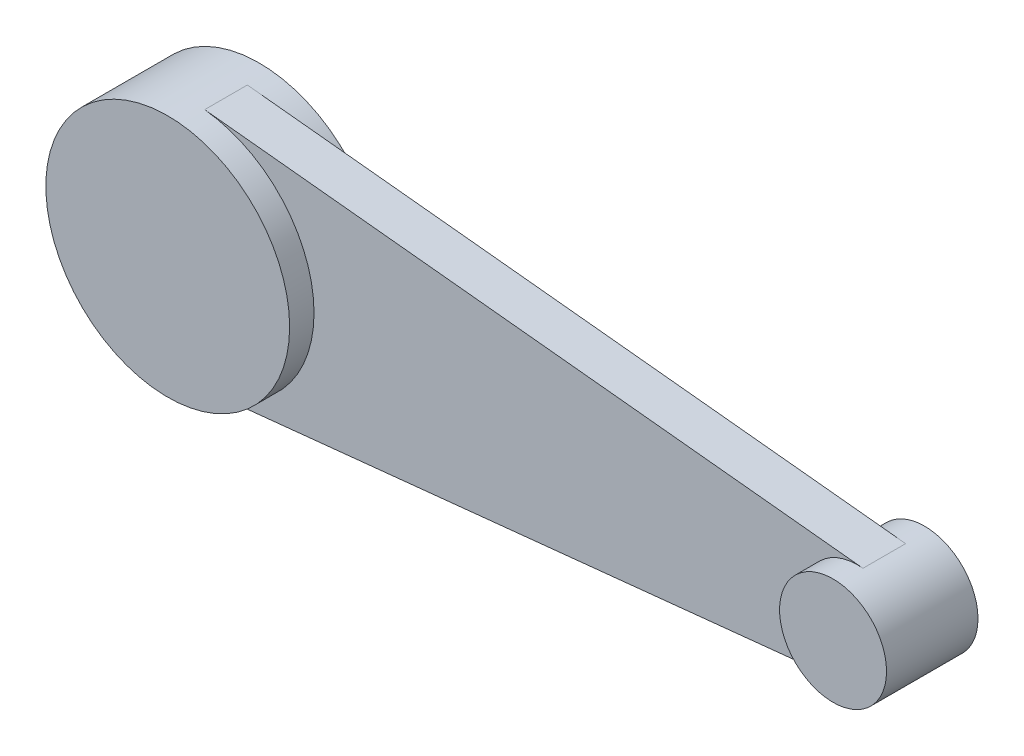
ISO-10303-21;
HEADER;
FILE_DESCRIPTION(('STEP AP214'),'2;1');
FILE_NAME('part.step','',(''),(''),'','','');
FILE_SCHEMA(('AUTOMOTIVE_DESIGN { 1 0 10303 214 1 1 1 1 }'));
ENDSEC;
DATA;
#1=APPLICATION_CONTEXT('core data for automotive mechanical design processes');
#2=APPLICATION_PROTOCOL_DEFINITION('international standard','automotive_design',2000,#1);
#3=PRODUCT_CONTEXT('',#1,'mechanical');
#4=PRODUCT('Part','Part','',(#3));
#5=PRODUCT_RELATED_PRODUCT_CATEGORY('part','',(#4));
#6=PRODUCT_DEFINITION_FORMATION('','',#4);
#7=PRODUCT_DEFINITION_CONTEXT('part definition',#1,'design');
#8=PRODUCT_DEFINITION('design','',#6,#7);
#9=PRODUCT_DEFINITION_SHAPE('','',#8);
#10=(LENGTH_UNIT() NAMED_UNIT(*) SI_UNIT(.MILLI.,.METRE.));
#11=(NAMED_UNIT(*) PLANE_ANGLE_UNIT() SI_UNIT($,.RADIAN.));
#12=(NAMED_UNIT(*) SI_UNIT($,.STERADIAN.) SOLID_ANGLE_UNIT());
#13=UNCERTAINTY_MEASURE_WITH_UNIT(LENGTH_MEASURE(1.E-05),#10,'distance_accuracy_value','');
#14=(GEOMETRIC_REPRESENTATION_CONTEXT(3) GLOBAL_UNCERTAINTY_ASSIGNED_CONTEXT((#13)) GLOBAL_UNIT_ASSIGNED_CONTEXT((#10,
#11,#12)) REPRESENTATION_CONTEXT('',''));
#15=CARTESIAN_POINT('',(0.,0.,0.));
#16=DIRECTION('',(0.,0.,1.));
#17=DIRECTION('',(1.,0.,0.));
#18=AXIS2_PLACEMENT_3D('',#15,#16,#17);
#19=CARTESIAN_POINT('',(-81.872176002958,0.,9.525));
#20=DIRECTION('',(0.,0.,-1.));
#21=DIRECTION('',(-1.,0.,0.));
#22=AXIS2_PLACEMENT_3D('',#19,#20,#21);
#23=CYLINDRICAL_SURFACE('',#22,25.3908383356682);
#24=DIRECTION('',(0.,0.,-1.));
#25=VECTOR('',#24,1.);
#26=CARTESIAN_POINT('',(-79.2607908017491,-25.2561940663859,4.445));
#27=LINE('',#26,#25);
#28=CARTESIAN_POINT('',(-79.2607908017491,-25.2561940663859,4.445));
#29=VERTEX_POINT('',#28);
#30=CARTESIAN_POINT('',(-79.2607908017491,-25.2561940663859,-4.445));
#31=VERTEX_POINT('',#30);
#32=EDGE_CURVE('E41',#29,#31,#27,.T.);
#33=ORIENTED_EDGE('',*,*,#32,.F.);
#34=CARTESIAN_POINT('',(-81.872176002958,0.,4.445));
#35=DIRECTION('',(0.,0.,-1.));
#36=DIRECTION('',(1.,0.,0.));
#37=AXIS2_PLACEMENT_3D('',#34,#35,#36);
#38=CIRCLE('',#37,25.3908383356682);
#39=CARTESIAN_POINT('',(-79.2607908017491,25.2561940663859,4.445));
#40=VERTEX_POINT('',#39);
#41=EDGE_CURVE('E46',#40,#29,#38,.T.);
#42=ORIENTED_EDGE('',*,*,#41,.F.);
#43=DIRECTION('',(0.,0.,-1.));
#44=VECTOR('',#43,1.);
#45=CARTESIAN_POINT('',(-79.2607908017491,25.2561940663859,4.445));
#46=LINE('',#45,#44);
#47=CARTESIAN_POINT('',(-79.2607908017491,25.2561940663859,-4.445));
#48=VERTEX_POINT('',#47);
#49=EDGE_CURVE('E86',#40,#48,#46,.T.);
#50=ORIENTED_EDGE('',*,*,#49,.T.);
#51=CARTESIAN_POINT('',(-81.872176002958,0.,-4.445));
#52=DIRECTION('',(0.,0.,-1.));
#53=DIRECTION('',(1.,0.,0.));
#54=AXIS2_PLACEMENT_3D('',#51,#52,#53);
#55=CIRCLE('',#54,25.3908383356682);
#56=EDGE_CURVE('E74',#48,#31,#55,.T.);
#57=ORIENTED_EDGE('',*,*,#56,.T.);
#58=EDGE_LOOP('',(#33,#42,#50,#57));
#59=FACE_BOUND('',#58,.T.);
#60=CARTESIAN_POINT('',(-81.872176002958,0.,9.525));
#61=DIRECTION('',(0.,0.,1.));
#62=DIRECTION('',(1.,0.,0.));
#63=AXIS2_PLACEMENT_3D('',#60,#61,#62);
#64=CIRCLE('',#63,25.3908383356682);
#65=CARTESIAN_POINT('',(-56.4813376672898,0.,9.525));
#66=VERTEX_POINT('',#65);
#67=EDGE_CURVE('E11',#66,#66,#64,.T.);
#68=ORIENTED_EDGE('',*,*,#67,.F.);
#69=EDGE_LOOP('',(#68));
#70=FACE_BOUND('',#69,.T.);
#71=CARTESIAN_POINT('',(-81.872176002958,0.,-9.525));
#72=DIRECTION('',(0.,0.,1.));
#73=DIRECTION('',(1.,0.,0.));
#74=AXIS2_PLACEMENT_3D('',#71,#72,#73);
#75=CIRCLE('',#74,25.3908383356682);
#76=CARTESIAN_POINT('',(-56.4813376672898,0.,-9.525));
#77=VERTEX_POINT('',#76);
#78=EDGE_CURVE('E34',#77,#77,#75,.T.);
#79=ORIENTED_EDGE('',*,*,#78,.T.);
#80=EDGE_LOOP('',(#79));
#81=FACE_BOUND('',#80,.T.);
#82=ADVANCED_FACE('F27',(#59,#70,#81),#23,.T.);
#83=CARTESIAN_POINT('',(-81.872176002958,0.,9.525));
#84=DIRECTION('',(0.,0.,1.));
#85=DIRECTION('',(1.,0.,0.));
#86=AXIS2_PLACEMENT_3D('',#83,#84,#85);
#87=PLANE('',#86);
#88=ORIENTED_EDGE('',*,*,#67,.T.);
#89=EDGE_LOOP('',(#88));
#90=FACE_BOUND('',#89,.T.);
#91=ADVANCED_FACE('F111',(#90),#87,.T.);
#92=CARTESIAN_POINT('',(-81.872176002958,0.,-9.525));
#93=DIRECTION('',(0.,0.,1.));
#94=DIRECTION('',(1.,0.,0.));
#95=AXIS2_PLACEMENT_3D('',#92,#93,#94);
#96=PLANE('',#95);
#97=ORIENTED_EDGE('',*,*,#78,.F.);
#98=EDGE_LOOP('',(#97));
#99=FACE_BOUND('',#98,.T.);
#100=ADVANCED_FACE('F108',(#99),#96,.F.);
#101=CARTESIAN_POINT('',(-79.2607908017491,-25.2561940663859,4.445));
#102=DIRECTION('',(-0.102847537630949,0.994697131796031,0.));
#103=DIRECTION('',(-0.994697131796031,-0.102847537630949,0.));
#104=AXIS2_PLACEMENT_3D('',#101,#102,#103);
#105=PLANE('',#104);
#106=DIRECTION('',(0.994697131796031,0.102847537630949,0.));
#107=VECTOR('',#106,1.);
#108=CARTESIAN_POINT('',(-79.2607908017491,-25.2561940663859,-4.445));
#109=LINE('',#108,#107);
#110=CARTESIAN_POINT('',(57.8459146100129,-11.0799321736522,-4.445));
#111=VERTEX_POINT('',#110);
#112=EDGE_CURVE('E91',#31,#111,#109,.T.);
#113=ORIENTED_EDGE('',*,*,#112,.T.);
#114=DIRECTION('',(0.,0.,-1.));
#115=VECTOR('',#114,1.);
#116=CARTESIAN_POINT('',(57.8459146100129,-11.0799321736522,4.445));
#117=LINE('',#116,#115);
#118=CARTESIAN_POINT('',(57.8459146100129,-11.0799321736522,4.445));
#119=VERTEX_POINT('',#118);
#120=EDGE_CURVE('E85',#119,#111,#117,.T.);
#121=ORIENTED_EDGE('',*,*,#120,.F.);
#122=DIRECTION('',(0.994697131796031,0.102847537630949,0.));
#123=VECTOR('',#122,1.);
#124=CARTESIAN_POINT('',(-79.2607908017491,-25.2561940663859,4.445));
#125=LINE('',#124,#123);
#126=EDGE_CURVE('E97',#29,#119,#125,.T.);
#127=ORIENTED_EDGE('',*,*,#126,.F.);
#128=ORIENTED_EDGE('',*,*,#32,.T.);
#129=EDGE_LOOP('',(#113,#121,#127,#128));
#130=FACE_BOUND('',#129,.T.);
#131=ADVANCED_FACE('F110',(#130),#105,.F.);
#132=CARTESIAN_POINT('',(-79.2607908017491,25.2561940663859,4.445));
#133=DIRECTION('',(-0.102847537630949,-0.994697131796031,0.));
#134=DIRECTION('',(0.994697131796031,-0.102847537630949,0.));
#135=AXIS2_PLACEMENT_3D('',#132,#133,#134);
#136=PLANE('',#135);
#137=DIRECTION('',(-0.994697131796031,0.102847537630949,0.));
#138=VECTOR('',#137,1.);
#139=CARTESIAN_POINT('',(-79.2607908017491,25.2561940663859,-4.445));
#140=LINE('',#139,#138);
#141=CARTESIAN_POINT('',(57.8459146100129,11.0799321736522,-4.445));
#142=VERTEX_POINT('',#141);
#143=EDGE_CURVE('E67',#142,#48,#140,.T.);
#144=ORIENTED_EDGE('',*,*,#143,.T.);
#145=ORIENTED_EDGE('',*,*,#49,.F.);
#146=DIRECTION('',(-0.994697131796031,0.102847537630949,0.));
#147=VECTOR('',#146,1.);
#148=CARTESIAN_POINT('',(-79.2607908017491,25.2561940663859,4.445));
#149=LINE('',#148,#147);
#150=CARTESIAN_POINT('',(57.8459146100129,11.0799321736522,4.445));
#151=VERTEX_POINT('',#150);
#152=EDGE_CURVE('E82',#151,#40,#149,.T.);
#153=ORIENTED_EDGE('',*,*,#152,.F.);
#154=DIRECTION('',(0.,0.,-1.));
#155=VECTOR('',#154,1.);
#156=CARTESIAN_POINT('',(57.8459146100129,11.0799321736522,4.445));
#157=LINE('',#156,#155);
#158=EDGE_CURVE('E80',#151,#142,#157,.T.);
#159=ORIENTED_EDGE('',*,*,#158,.T.);
#160=EDGE_LOOP('',(#144,#145,#153,#159));
#161=FACE_BOUND('',#160,.T.);
#162=ADVANCED_FACE('F81',(#161),#136,.F.);
#163=CARTESIAN_POINT('',(-81.872176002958,0.,4.445));
#164=DIRECTION('',(0.,0.,1.));
#165=DIRECTION('',(1.,0.,0.));
#166=AXIS2_PLACEMENT_3D('',#163,#164,#165);
#167=PLANE('',#166);
#168=ORIENTED_EDGE('',*,*,#41,.T.);
#169=ORIENTED_EDGE('',*,*,#126,.T.);
#170=CARTESIAN_POINT('',(56.7002958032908,0.,4.445));
#171=DIRECTION('',(0.,0.,-1.));
#172=DIRECTION('',(1.,0.,0.));
#173=AXIS2_PLACEMENT_3D('',#170,#171,#172);
#174=CIRCLE('',#173,11.1390008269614);
#175=EDGE_CURVE('E99',#119,#151,#174,.T.);
#176=ORIENTED_EDGE('',*,*,#175,.T.);
#177=ORIENTED_EDGE('',*,*,#152,.T.);
#178=EDGE_LOOP('',(#168,#169,#176,#177));
#179=FACE_BOUND('',#178,.T.);
#180=ADVANCED_FACE('F137',(#179),#167,.T.);
#181=CARTESIAN_POINT('',(-81.872176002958,0.,-4.445));
#182=DIRECTION('',(0.,0.,1.));
#183=DIRECTION('',(1.,0.,0.));
#184=AXIS2_PLACEMENT_3D('',#181,#182,#183);
#185=PLANE('',#184);
#186=ORIENTED_EDGE('',*,*,#56,.F.);
#187=ORIENTED_EDGE('',*,*,#143,.F.);
#188=CARTESIAN_POINT('',(56.7002958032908,0.,-4.445));
#189=DIRECTION('',(0.,0.,-1.));
#190=DIRECTION('',(1.,0.,0.));
#191=AXIS2_PLACEMENT_3D('',#188,#189,#190);
#192=CIRCLE('',#191,11.1390008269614);
#193=EDGE_CURVE('E72',#111,#142,#192,.T.);
#194=ORIENTED_EDGE('',*,*,#193,.F.);
#195=ORIENTED_EDGE('',*,*,#112,.F.);
#196=EDGE_LOOP('',(#186,#187,#194,#195));
#197=FACE_BOUND('',#196,.T.);
#198=ADVANCED_FACE('F69',(#197),#185,.F.);
#199=CARTESIAN_POINT('',(56.7002958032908,0.,9.525));
#200=DIRECTION('',(0.,0.,-1.));
#201=DIRECTION('',(-1.,0.,0.));
#202=AXIS2_PLACEMENT_3D('',#199,#200,#201);
#203=CYLINDRICAL_SURFACE('',#202,11.1390008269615);
#204=ORIENTED_EDGE('',*,*,#175,.F.);
#205=ORIENTED_EDGE('',*,*,#120,.T.);
#206=ORIENTED_EDGE('',*,*,#193,.T.);
#207=ORIENTED_EDGE('',*,*,#158,.F.);
#208=EDGE_LOOP('',(#204,#205,#206,#207));
#209=FACE_BOUND('',#208,.T.);
#210=CARTESIAN_POINT('',(56.7002958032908,0.,9.525));
#211=DIRECTION('',(0.,0.,1.));
#212=DIRECTION('',(1.,0.,0.));
#213=AXIS2_PLACEMENT_3D('',#210,#211,#212);
#214=CIRCLE('',#213,11.1390008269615);
#215=CARTESIAN_POINT('',(67.8392966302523,0.,9.525));
#216=VERTEX_POINT('',#215);
#217=EDGE_CURVE('E178',#216,#216,#214,.T.);
#218=ORIENTED_EDGE('',*,*,#217,.F.);
#219=EDGE_LOOP('',(#218));
#220=FACE_BOUND('',#219,.T.);
#221=CARTESIAN_POINT('',(56.7002958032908,0.,-9.525));
#222=DIRECTION('',(0.,0.,1.));
#223=DIRECTION('',(1.,0.,0.));
#224=AXIS2_PLACEMENT_3D('',#221,#222,#223);
#225=CIRCLE('',#224,11.1390008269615);
#226=CARTESIAN_POINT('',(67.8392966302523,0.,-9.525));
#227=VERTEX_POINT('',#226);
#228=EDGE_CURVE('E176',#227,#227,#225,.T.);
#229=ORIENTED_EDGE('',*,*,#228,.T.);
#230=EDGE_LOOP('',(#229));
#231=FACE_BOUND('',#230,.T.);
#232=ADVANCED_FACE('F88',(#209,#220,#231),#203,.T.);
#233=CARTESIAN_POINT('',(56.7002958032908,0.,9.525));
#234=DIRECTION('',(0.,0.,1.));
#235=DIRECTION('',(1.,0.,0.));
#236=AXIS2_PLACEMENT_3D('',#233,#234,#235);
#237=PLANE('',#236);
#238=ORIENTED_EDGE('',*,*,#217,.T.);
#239=EDGE_LOOP('',(#238));
#240=FACE_BOUND('',#239,.T.);
#241=ADVANCED_FACE('F157',(#240),#237,.T.);
#242=CARTESIAN_POINT('',(56.7002958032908,0.,-9.525));
#243=DIRECTION('',(0.,0.,1.));
#244=DIRECTION('',(1.,0.,0.));
#245=AXIS2_PLACEMENT_3D('',#242,#243,#244);
#246=PLANE('',#245);
#247=ORIENTED_EDGE('',*,*,#228,.F.);
#248=EDGE_LOOP('',(#247));
#249=FACE_BOUND('',#248,.T.);
#250=ADVANCED_FACE('F164',(#249),#246,.F.);
#251=CLOSED_SHELL('',(#82,#91,#100,#131,#162,#180,#198,#232,#241,#250));
#252=MANIFOLD_SOLID_BREP('B2',#251);
#253=ADVANCED_BREP_SHAPE_REPRESENTATION('',(#18,#252),#14);
#254=SHAPE_DEFINITION_REPRESENTATION(#9,#253);
ENDSEC;
END-ISO-10303-21;
